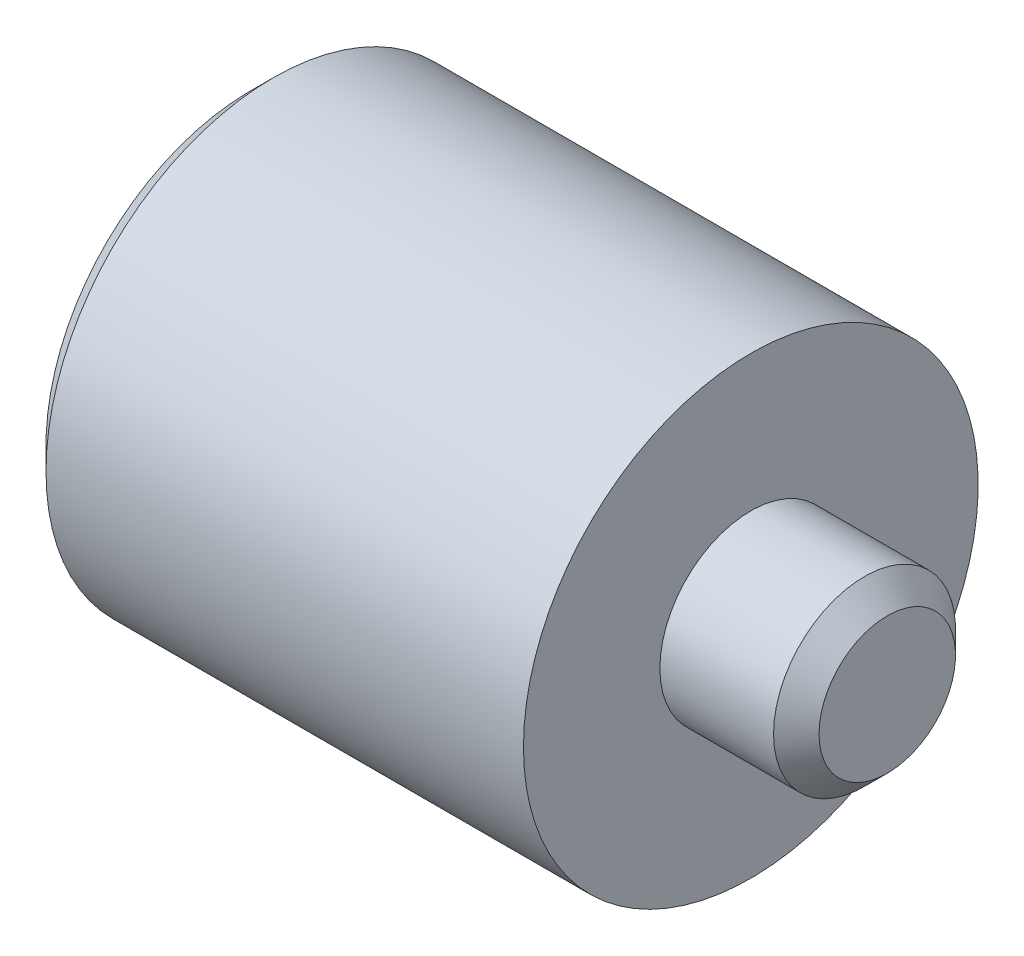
from build123d import *

# Parameters (mm, degrees)
CHANFREIN1_SIZE = 0.5


with BuildPart() as part:
    # Esquisse1 → Base-R_volution (revolve)
    with BuildSketch(Plane.XY, mode=Mode.PRIVATE) as base_r_volution_sk:
        Polygon((0, 0), (0, 5), (11, 5), (11, 2), (14, 2), (14, 0), align=None)
    revolve(base_r_volution_sk.sketch.rotate(Axis((-13.008502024, 0, 0), (1, 0, 0)), 90), axis=Axis((-13.008502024, 0, 0), (1, 0, 0)))

    # Chanfrein1
    chanfrein1_edges = [part.edges().sort_by_distance(p)[0] for p in [
        (0, 0, -5),
        (14, 0, -2),
    ]]
    chamfer(chanfrein1_edges, length=CHANFREIN1_SIZE)


solid = part.part
